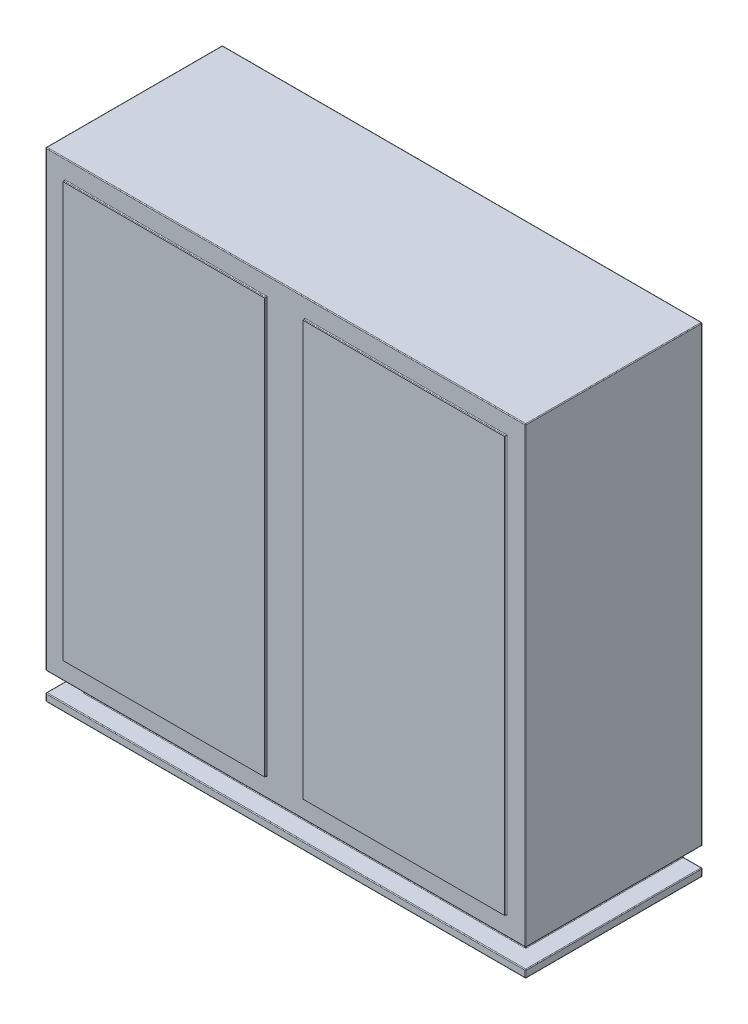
from build123d import *

# Parameters (mm, degrees)
BOSS_EXTRU_1_DEPTH      = 625
ESQUISSE4_W             = 50
ESQUISSE4_H             = 50
ENL_V_MAT_EXTRU_1_DEPTH = 1472.300445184
ESQUISSE5_W             = 525
ESQUISSE5_H             = 1080
BOSS_EXTRU_2_DEPTH      = 5
CONG_1_R                = 2


with BuildPart() as part:
    # Esquisse1 → Boss.-Extru.1 (new, symmetric)
    with BuildSketch(Plane(origin=(0, 0, 0), x_dir=(0, 0, -1), z_dir=(1, 0, 0))):
        Polygon((-230, 0), (230, 0), (230, 1250), (-230, 1250), (-230, 70), (-180, 70), (-180, 20), (-230, 20), align=None)
    extrude(amount=BOSS_EXTRU_1_DEPTH, both=True)

    # Esquisse4 → Enl_v. mat.-Extru.1 (cut, through all)
    with BuildSketch(Plane.XY.offset(230)):
        with Locations((-600, 45)):
            Rectangle(ESQUISSE4_W, ESQUISSE4_H)
        with Locations((600, 45)):
            Rectangle(ESQUISSE4_W, ESQUISSE4_H)
    extrude(amount=-ENL_V_MAT_EXTRU_1_DEPTH, mode=Mode.SUBTRACT)

    # Esquisse5 → Boss.-Extru.2 (add)
    with BuildSketch(Plane.XY.offset(230)):
        with Locations((-312.5, 660)):
            Rectangle(ESQUISSE5_W, ESQUISSE5_H)
        with Locations((312.5, 660)):
            Rectangle(ESQUISSE5_W, ESQUISSE5_H)
    extrude(amount=BOSS_EXTRU_2_DEPTH)

    # Cong_1
    cong_1_edges = [part.edges().sort_by_distance(p)[0] for p in [
        (625, 10, -230),
        (-625, 0, 0),
        (-625, 10, 230),
        (625, 1250, 0),
        (0, 20, 230),
        (0, 70, 230),
        (0, 1250, 230),
        (0, 1250, -230),
        (0, 0, -230),
        (0, 0, 230),
        (625, 660, 230),
        (625, 70, 0),
        (-625, 660, -230),
        (625, 20, 0),
        (-575, 70, -25),
        (-575, 45, 180),
        (-575, 45, -230),
        (-600, 70, -230),
        (-575, 20, -25),
        (-600, 20, -230),
        (625, 10, 230),
        (625, 660, -230),
        (0, 20, 180),
        (0, 70, 180),
        (575, 20, -25),
        (575, 45, 180),
        (575, 45, -230),
        (600, 20, -230),
        (575, 70, -25),
        (600, 70, -230),
        (-575, 660, 230),
        (-312.5, 120, 230),
        (-50, 660, 230),
        (-312.5, 1200, 230),
        (625, 0, 0),
        (50, 660, 230),
        (312.5, 120, 230),
        (-625, 20, 0),
        (575, 660, 230),
        (312.5, 1200, 230),
        (-625, 70, 0),
        (-625, 660, 230),
        (-625, 1250, 0),
        (-625, 10, -230),
    ]]
    fillet(cong_1_edges, radius=CONG_1_R)


solid = part.part
